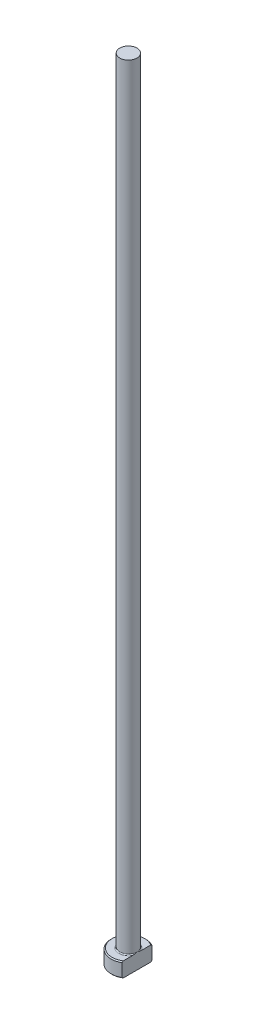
from build123d import *
from build123d.topology import SkipClean

# Parameters (mm, degrees)
CHAMFER1_SIZE = 0.2
FILLET1_R     = 0.2
KEY_DEPTH     = 161.076544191


with BuildPart() as part:
    # Sketch1 → Revolve1 (revolve)
    with BuildSketch(Plane.XY, mode=Mode.PRIVATE) as revolve1_sk:
        Polygon((0, 0), (-3.5, 0), (-3.5, 3), (-1.75, 3), (-1.75, 160), (0, 160), align=None)
    revolve(revolve1_sk.sketch.rotate(Axis((0, 259.958771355, 0), (0, -1, 0)), 270), axis=Axis((0, 259.958771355, 0), (0, -1, 0)))

    # Chamfer1
    chamfer1_edges = [part.edges().sort_by_distance(p)[0] for p in [
        (0, 3, -3.5),
        (0, 0, -3.5),
    ]]
    chamfer(chamfer1_edges, length=CHAMFER1_SIZE)

    # Fillet1
    fillet1_edges = [part.edges().sort_by_distance(p)[0] for p in [
        (0, 3, -1.75),
    ]]
    fillet(fillet1_edges, radius=FILLET1_R)

    # Sketch2 → KEY (cut, through all)
    with SkipClean():  # the faces are left unmerged after this step: merging them gives an invalid solid
        with BuildSketch(Plane(origin=(0, 0, 0), x_dir=(1, 0, 0), z_dir=(0, 1, 0))):
            with BuildLine():
                Line((1.75, 3.031088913), (1.75, -3.031088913))
                ThreePointArc((1.75, -3.031088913), (3.5, 0), (1.75, 3.031088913))
            make_face()
        extrude(amount=KEY_DEPTH, mode=Mode.SUBTRACT)


solid = part.part
